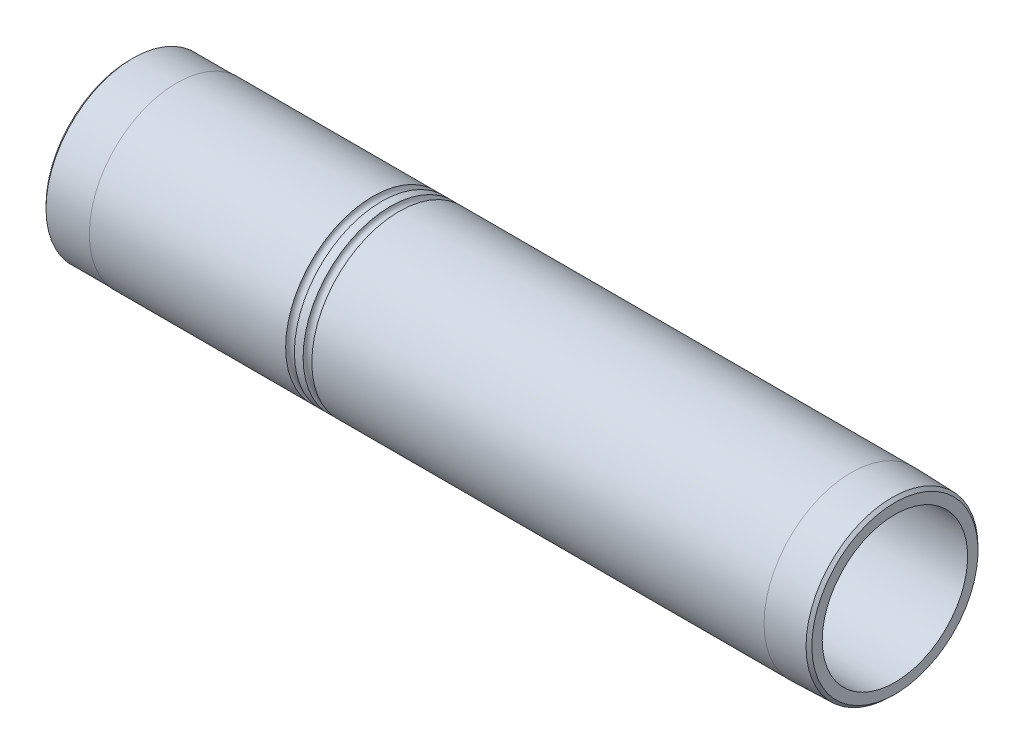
ISO-10303-21;
HEADER;
FILE_DESCRIPTION(('STEP AP214'),'2;1');
FILE_NAME('part.step','',(''),(''),'','','');
FILE_SCHEMA(('AUTOMOTIVE_DESIGN { 1 0 10303 214 1 1 1 1 }'));
ENDSEC;
DATA;
#1=APPLICATION_CONTEXT('core data for automotive mechanical design processes');
#2=APPLICATION_PROTOCOL_DEFINITION('international standard','automotive_design',2000,#1);
#3=PRODUCT_CONTEXT('',#1,'mechanical');
#4=PRODUCT('Part','Part','',(#3));
#5=PRODUCT_RELATED_PRODUCT_CATEGORY('part','',(#4));
#6=PRODUCT_DEFINITION_FORMATION('','',#4);
#7=PRODUCT_DEFINITION_CONTEXT('part definition',#1,'design');
#8=PRODUCT_DEFINITION('design','',#6,#7);
#9=PRODUCT_DEFINITION_SHAPE('','',#8);
#10=(LENGTH_UNIT() NAMED_UNIT(*) SI_UNIT(.MILLI.,.METRE.));
#11=(NAMED_UNIT(*) PLANE_ANGLE_UNIT() SI_UNIT($,.RADIAN.));
#12=(NAMED_UNIT(*) SI_UNIT($,.STERADIAN.) SOLID_ANGLE_UNIT());
#13=UNCERTAINTY_MEASURE_WITH_UNIT(LENGTH_MEASURE(1.E-05),#10,'distance_accuracy_value','');
#14=(GEOMETRIC_REPRESENTATION_CONTEXT(3) GLOBAL_UNCERTAINTY_ASSIGNED_CONTEXT((#13)) GLOBAL_UNIT_ASSIGNED_CONTEXT((#10,
#11,#12)) REPRESENTATION_CONTEXT('',''));
#15=CARTESIAN_POINT('',(0.,0.,0.));
#16=DIRECTION('',(0.,0.,1.));
#17=DIRECTION('',(1.,0.,0.));
#18=AXIS2_PLACEMENT_3D('',#15,#16,#17);
#19=CARTESIAN_POINT('',(0.,0.,0.));
#20=DIRECTION('',(-1.,0.,0.));
#21=DIRECTION('',(0.,0.,1.));
#22=AXIS2_PLACEMENT_3D('',#19,#20,#21);
#23=CYLINDRICAL_SURFACE('',#22,25.);
#24=CARTESIAN_POINT('',(165.,0.,0.));
#25=DIRECTION('',(-1.,0.,0.));
#26=DIRECTION('',(0.,0.,1.));
#27=AXIS2_PLACEMENT_3D('',#24,#25,#26);
#28=CIRCLE('',#27,25.);
#29=CARTESIAN_POINT('',(165.,0.,25.));
#30=VERTEX_POINT('',#29);
#31=EDGE_CURVE('E68',#30,#30,#28,.F.);
#32=ORIENTED_EDGE('',*,*,#31,.F.);
#33=EDGE_LOOP('',(#32));
#34=FACE_BOUND('',#33,.T.);
#35=CARTESIAN_POINT('',(211.8,0.,0.));
#36=DIRECTION('',(1.,0.,0.));
#37=DIRECTION('',(0.,0.,-1.));
#38=AXIS2_PLACEMENT_3D('',#35,#36,#37);
#39=CIRCLE('',#38,25.);
#40=CARTESIAN_POINT('',(211.8,0.,-25.));
#41=VERTEX_POINT('',#40);
#42=EDGE_CURVE('E39',#41,#41,#39,.F.);
#43=ORIENTED_EDGE('',*,*,#42,.F.);
#44=EDGE_LOOP('',(#43));
#45=FACE_BOUND('',#44,.T.);
#46=ADVANCED_FACE('F35',(#34,#45),#23,.F.);
#47=CARTESIAN_POINT('',(428.,0.,0.));
#48=DIRECTION('',(-1.,0.,0.));
#49=DIRECTION('',(0.,0.,1.));
#50=AXIS2_PLACEMENT_3D('',#47,#48,#49);
#51=CIRCLE('',#50,25.);
#52=CARTESIAN_POINT('',(428.,0.,25.));
#53=VERTEX_POINT('',#52);
#54=EDGE_CURVE('E48',#53,#53,#51,.T.);
#55=ORIENTED_EDGE('',*,*,#54,.F.);
#56=EDGE_LOOP('',(#55));
#57=FACE_BOUND('',#56,.T.);
#58=CARTESIAN_POINT('',(215.,0.,0.));
#59=DIRECTION('',(-1.,0.,0.));
#60=DIRECTION('',(0.,0.,1.));
#61=AXIS2_PLACEMENT_3D('',#58,#59,#60);
#62=CIRCLE('',#61,25.);
#63=CARTESIAN_POINT('',(215.,0.,25.));
#64=VERTEX_POINT('',#63);
#65=EDGE_CURVE('E75',#64,#64,#62,.F.);
#66=ORIENTED_EDGE('',*,*,#65,.F.);
#67=EDGE_LOOP('',(#66));
#68=FACE_BOUND('',#67,.T.);
#69=ADVANCED_FACE('F111',(#57,#68),#23,.F.);
#70=CARTESIAN_POINT('',(0.,0.,0.));
#71=DIRECTION('',(-1.,0.,0.));
#72=DIRECTION('',(0.,0.,1.));
#73=AXIS2_PLACEMENT_3D('',#70,#71,#72);
#74=CYLINDRICAL_SURFACE('',#73,30.);
#75=CARTESIAN_POINT('',(248.5,0.,0.));
#76=DIRECTION('',(1.,0.,0.));
#77=DIRECTION('',(0.,0.,-1.));
#78=AXIS2_PLACEMENT_3D('',#75,#76,#77);
#79=CIRCLE('',#78,30.);
#80=CARTESIAN_POINT('',(248.5,0.,-30.));
#81=VERTEX_POINT('',#80);
#82=EDGE_CURVE('E60',#81,#81,#79,.T.);
#83=ORIENTED_EDGE('',*,*,#82,.F.);
#84=EDGE_LOOP('',(#83));
#85=FACE_BOUND('',#84,.T.);
#86=CARTESIAN_POINT('',(181.,0.,0.));
#87=DIRECTION('',(-1.,0.,0.));
#88=DIRECTION('',(0.,0.,1.));
#89=AXIS2_PLACEMENT_3D('',#86,#87,#88);
#90=CIRCLE('',#89,30.);
#91=CARTESIAN_POINT('',(181.,0.,30.));
#92=VERTEX_POINT('',#91);
#93=EDGE_CURVE('E71',#92,#92,#90,.T.);
#94=ORIENTED_EDGE('',*,*,#93,.F.);
#95=EDGE_LOOP('',(#94));
#96=FACE_BOUND('',#95,.T.);
#97=ADVANCED_FACE('F114',(#85,#96),#74,.T.);
#98=CARTESIAN_POINT('',(254.5,0.,0.));
#99=DIRECTION('',(1.,0.,0.));
#100=DIRECTION('',(0.,0.,-1.));
#101=AXIS2_PLACEMENT_3D('',#98,#99,#100);
#102=CIRCLE('',#101,30.);
#103=CARTESIAN_POINT('',(254.5,0.,-30.));
#104=VERTEX_POINT('',#103);
#105=EDGE_CURVE('E55',#104,#104,#102,.T.);
#106=ORIENTED_EDGE('',*,*,#105,.F.);
#107=EDGE_LOOP('',(#106));
#108=FACE_BOUND('',#107,.T.);
#109=CARTESIAN_POINT('',(251.5,0.,0.));
#110=DIRECTION('',(-1.,0.,0.));
#111=DIRECTION('',(0.,0.,1.));
#112=AXIS2_PLACEMENT_3D('',#109,#110,#111);
#113=CIRCLE('',#112,30.);
#114=CARTESIAN_POINT('',(251.5,0.,30.));
#115=VERTEX_POINT('',#114);
#116=EDGE_CURVE('E63',#115,#115,#113,.T.);
#117=ORIENTED_EDGE('',*,*,#116,.F.);
#118=EDGE_LOOP('',(#117));
#119=FACE_BOUND('',#118,.T.);
#120=ADVANCED_FACE('F120',(#108,#119),#74,.T.);
#121=CARTESIAN_POINT('',(413.,0.,0.));
#122=DIRECTION('',(-1.,0.,0.));
#123=DIRECTION('',(0.,0.,1.));
#124=AXIS2_PLACEMENT_3D('',#121,#122,#123);
#125=CIRCLE('',#124,30.);
#126=CARTESIAN_POINT('',(413.,0.,30.));
#127=VERTEX_POINT('',#126);
#128=EDGE_CURVE('E59',#127,#127,#125,.T.);
#129=ORIENTED_EDGE('',*,*,#128,.T.);
#130=EDGE_LOOP('',(#129));
#131=FACE_BOUND('',#130,.T.);
#132=CARTESIAN_POINT('',(257.5,0.,0.));
#133=DIRECTION('',(-1.,0.,0.));
#134=DIRECTION('',(0.,0.,1.));
#135=AXIS2_PLACEMENT_3D('',#132,#133,#134);
#136=CIRCLE('',#135,30.);
#137=CARTESIAN_POINT('',(257.5,0.,30.));
#138=VERTEX_POINT('',#137);
#139=EDGE_CURVE('E52',#138,#138,#136,.T.);
#140=ORIENTED_EDGE('',*,*,#139,.F.);
#141=EDGE_LOOP('',(#140));
#142=FACE_BOUND('',#141,.T.);
#143=ADVANCED_FACE('F123',(#131,#142),#74,.T.);
#144=CARTESIAN_POINT('',(427.,0.,0.));
#145=DIRECTION('',(-1.,0.,0.));
#146=DIRECTION('',(0.,0.,1.));
#147=AXIS2_PLACEMENT_3D('',#144,#145,#146);
#148=CONICAL_SURFACE('',#147,29.5654131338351,0.0310319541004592);
#149=ORIENTED_EDGE('',*,*,#128,.F.);
#150=EDGE_LOOP('',(#149));
#151=FACE_BOUND('',#150,.T.);
#152=CARTESIAN_POINT('',(427.,0.,0.));
#153=DIRECTION('',(-1.,0.,0.));
#154=DIRECTION('',(0.,0.,1.));
#155=AXIS2_PLACEMENT_3D('',#152,#153,#154);
#156=CIRCLE('',#155,29.5654131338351);
#157=CARTESIAN_POINT('',(427.,0.,29.5654131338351));
#158=VERTEX_POINT('',#157);
#159=EDGE_CURVE('E10',#158,#158,#156,.T.);
#160=ORIENTED_EDGE('',*,*,#159,.T.);
#161=EDGE_LOOP('',(#160));
#162=FACE_BOUND('',#161,.T.);
#163=ADVANCED_FACE('F37',(#151,#162),#148,.T.);
#164=CARTESIAN_POINT('',(428.,0.,0.));
#165=DIRECTION('',(-1.,0.,0.));
#166=DIRECTION('',(0.,0.,1.));
#167=AXIS2_PLACEMENT_3D('',#164,#165,#166);
#168=CONICAL_SURFACE('',#167,28.5654131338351,0.785398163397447);
#169=ORIENTED_EDGE('',*,*,#159,.F.);
#170=EDGE_LOOP('',(#169));
#171=FACE_BOUND('',#170,.T.);
#172=CARTESIAN_POINT('',(428.,0.,0.));
#173=DIRECTION('',(-1.,0.,0.));
#174=DIRECTION('',(0.,0.,1.));
#175=AXIS2_PLACEMENT_3D('',#172,#173,#174);
#176=CIRCLE('',#175,28.5654131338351);
#177=CARTESIAN_POINT('',(428.,0.,28.5654131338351));
#178=VERTEX_POINT('',#177);
#179=EDGE_CURVE('E43',#178,#178,#176,.T.);
#180=ORIENTED_EDGE('',*,*,#179,.T.);
#181=EDGE_LOOP('',(#180));
#182=FACE_BOUND('',#181,.T.);
#183=ADVANCED_FACE('F129',(#171,#182),#168,.T.);
#184=CARTESIAN_POINT('',(428.,28.5654131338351,0.));
#185=DIRECTION('',(-1.,0.,0.));
#186=DIRECTION('',(0.,0.,1.));
#187=AXIS2_PLACEMENT_3D('',#184,#185,#186);
#188=PLANE('',#187);
#189=ORIENTED_EDGE('',*,*,#179,.F.);
#190=EDGE_LOOP('',(#189));
#191=FACE_BOUND('',#190,.T.);
#192=ORIENTED_EDGE('',*,*,#54,.T.);
#193=EDGE_LOOP('',(#192));
#194=FACE_BOUND('',#193,.T.);
#195=ADVANCED_FACE('F109',(#191,#194),#188,.F.);
#196=CARTESIAN_POINT('',(254.5,31.475,0.));
#197=DIRECTION('',(1.,0.,0.));
#198=DIRECTION('',(0.,0.,-1.));
#199=AXIS2_PLACEMENT_3D('',#196,#197,#198);
#200=PLANE('',#199);
#201=CARTESIAN_POINT('',(254.5,0.,0.));
#202=DIRECTION('',(-1.,0.,0.));
#203=DIRECTION('',(0.,0.,1.));
#204=AXIS2_PLACEMENT_3D('',#201,#202,#203);
#205=CIRCLE('',#204,29.975);
#206=CARTESIAN_POINT('',(254.5,0.,29.975));
#207=VERTEX_POINT('',#206);
#208=EDGE_CURVE('E56',#207,#207,#205,.T.);
#209=ORIENTED_EDGE('',*,*,#208,.T.);
#210=EDGE_LOOP('',(#209));
#211=FACE_BOUND('',#210,.T.);
#212=ORIENTED_EDGE('',*,*,#105,.T.);
#213=EDGE_LOOP('',(#212));
#214=FACE_BOUND('',#213,.T.);
#215=ADVANCED_FACE('F128',(#211,#214),#200,.T.);
#216=CARTESIAN_POINT('',(257.5,31.475,0.));
#217=DIRECTION('',(-1.,0.,0.));
#218=DIRECTION('',(0.,0.,1.));
#219=AXIS2_PLACEMENT_3D('',#216,#217,#218);
#220=PLANE('',#219);
#221=CARTESIAN_POINT('',(257.5,0.,0.));
#222=DIRECTION('',(-1.,0.,0.));
#223=DIRECTION('',(0.,0.,1.));
#224=AXIS2_PLACEMENT_3D('',#221,#222,#223);
#225=CIRCLE('',#224,29.975);
#226=CARTESIAN_POINT('',(257.5,0.,29.975));
#227=VERTEX_POINT('',#226);
#228=EDGE_CURVE('E67',#227,#227,#225,.T.);
#229=ORIENTED_EDGE('',*,*,#228,.F.);
#230=EDGE_LOOP('',(#229));
#231=FACE_BOUND('',#230,.T.);
#232=ORIENTED_EDGE('',*,*,#139,.T.);
#233=EDGE_LOOP('',(#232));
#234=FACE_BOUND('',#233,.T.);
#235=ADVANCED_FACE('F147',(#231,#234),#220,.T.);
#236=CARTESIAN_POINT('',(256.,0.,0.));
#237=DIRECTION('',(-1.,0.,0.));
#238=DIRECTION('',(0.,0.,1.));
#239=AXIS2_PLACEMENT_3D('',#236,#237,#238);
#240=TOROIDAL_SURFACE('',#239,29.975,1.49999999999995);
#241=ORIENTED_EDGE('',*,*,#228,.T.);
#242=EDGE_LOOP('',(#241));
#243=FACE_BOUND('',#242,.T.);
#244=ORIENTED_EDGE('',*,*,#208,.F.);
#245=EDGE_LOOP('',(#244));
#246=FACE_BOUND('',#245,.T.);
#247=ADVANCED_FACE('F149',(#243,#246),#240,.F.);
#248=CARTESIAN_POINT('',(251.5,31.475,0.));
#249=DIRECTION('',(-1.,0.,0.));
#250=DIRECTION('',(0.,0.,1.));
#251=AXIS2_PLACEMENT_3D('',#248,#249,#250);
#252=PLANE('',#251);
#253=CARTESIAN_POINT('',(251.5,0.,0.));
#254=DIRECTION('',(-1.,0.,0.));
#255=DIRECTION('',(0.,0.,1.));
#256=AXIS2_PLACEMENT_3D('',#253,#254,#255);
#257=CIRCLE('',#256,29.975);
#258=CARTESIAN_POINT('',(251.5,0.,29.975));
#259=VERTEX_POINT('',#258);
#260=EDGE_CURVE('E64',#259,#259,#257,.T.);
#261=ORIENTED_EDGE('',*,*,#260,.F.);
#262=EDGE_LOOP('',(#261));
#263=FACE_BOUND('',#262,.T.);
#264=ORIENTED_EDGE('',*,*,#116,.T.);
#265=EDGE_LOOP('',(#264));
#266=FACE_BOUND('',#265,.T.);
#267=ADVANCED_FACE('F156',(#263,#266),#252,.T.);
#268=CARTESIAN_POINT('',(248.5,29.975,0.));
#269=DIRECTION('',(1.,0.,0.));
#270=DIRECTION('',(0.,0.,-1.));
#271=AXIS2_PLACEMENT_3D('',#268,#269,#270);
#272=PLANE('',#271);
#273=CARTESIAN_POINT('',(248.5,0.,0.));
#274=DIRECTION('',(-1.,0.,0.));
#275=DIRECTION('',(0.,0.,1.));
#276=AXIS2_PLACEMENT_3D('',#273,#274,#275);
#277=CIRCLE('',#276,29.975);
#278=CARTESIAN_POINT('',(248.5,0.,29.975));
#279=VERTEX_POINT('',#278);
#280=EDGE_CURVE('E74',#279,#279,#277,.T.);
#281=ORIENTED_EDGE('',*,*,#280,.T.);
#282=EDGE_LOOP('',(#281));
#283=FACE_BOUND('',#282,.T.);
#284=ORIENTED_EDGE('',*,*,#82,.T.);
#285=EDGE_LOOP('',(#284));
#286=FACE_BOUND('',#285,.T.);
#287=ADVANCED_FACE('F166',(#283,#286),#272,.T.);
#288=CARTESIAN_POINT('',(250.,0.,0.));
#289=DIRECTION('',(-1.,0.,0.));
#290=DIRECTION('',(0.,0.,1.));
#291=AXIS2_PLACEMENT_3D('',#288,#289,#290);
#292=TOROIDAL_SURFACE('',#291,29.975,1.49999999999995);
#293=ORIENTED_EDGE('',*,*,#260,.T.);
#294=EDGE_LOOP('',(#293));
#295=FACE_BOUND('',#294,.T.);
#296=ORIENTED_EDGE('',*,*,#280,.F.);
#297=EDGE_LOOP('',(#296));
#298=FACE_BOUND('',#297,.T.);
#299=ADVANCED_FACE('F162',(#295,#298),#292,.F.);
#300=CARTESIAN_POINT('',(181.,29.9,0.));
#301=DIRECTION('',(-1.,0.,0.));
#302=DIRECTION('',(0.,0.,1.));
#303=AXIS2_PLACEMENT_3D('',#300,#301,#302);
#304=PLANE('',#303);
#305=CARTESIAN_POINT('',(181.,0.,0.));
#306=DIRECTION('',(-1.,0.,0.));
#307=DIRECTION('',(0.,0.,1.));
#308=AXIS2_PLACEMENT_3D('',#305,#306,#307);
#309=CIRCLE('',#308,29.9);
#310=CARTESIAN_POINT('',(181.,0.,29.9));
#311=VERTEX_POINT('',#310);
#312=EDGE_CURVE('E81',#311,#311,#309,.T.);
#313=ORIENTED_EDGE('',*,*,#312,.F.);
#314=EDGE_LOOP('',(#313));
#315=FACE_BOUND('',#314,.T.);
#316=ORIENTED_EDGE('',*,*,#93,.T.);
#317=EDGE_LOOP('',(#316));
#318=FACE_BOUND('',#317,.T.);
#319=ADVANCED_FACE('F165',(#315,#318),#304,.T.);
#320=CARTESIAN_POINT('',(165.,0.,0.));
#321=DIRECTION('',(-1.,0.,0.));
#322=DIRECTION('',(0.,0.,1.));
#323=AXIS2_PLACEMENT_3D('',#320,#321,#322);
#324=PLANE('',#323);
#325=CARTESIAN_POINT('',(165.,0.,0.));
#326=DIRECTION('',(-1.,0.,0.));
#327=DIRECTION('',(0.,0.,1.));
#328=AXIS2_PLACEMENT_3D('',#325,#326,#327);
#329=CIRCLE('',#328,28.9);
#330=CARTESIAN_POINT('',(165.,0.,28.9));
#331=VERTEX_POINT('',#330);
#332=EDGE_CURVE('E72',#331,#331,#329,.T.);
#333=ORIENTED_EDGE('',*,*,#332,.T.);
#334=EDGE_LOOP('',(#333));
#335=FACE_BOUND('',#334,.T.);
#336=ORIENTED_EDGE('',*,*,#31,.T.);
#337=EDGE_LOOP('',(#336));
#338=FACE_BOUND('',#337,.T.);
#339=ADVANCED_FACE('F174',(#335,#338),#324,.T.);
#340=CARTESIAN_POINT('',(165.,0.,0.));
#341=DIRECTION('',(1.,0.,0.));
#342=DIRECTION('',(0.,0.,-1.));
#343=AXIS2_PLACEMENT_3D('',#340,#341,#342);
#344=CONICAL_SURFACE('',#343,28.9,0.785398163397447);
#345=CARTESIAN_POINT('',(166.,0.,0.));
#346=DIRECTION('',(-1.,0.,0.));
#347=DIRECTION('',(0.,0.,1.));
#348=AXIS2_PLACEMENT_3D('',#345,#346,#347);
#349=CIRCLE('',#348,29.9);
#350=CARTESIAN_POINT('',(166.,0.,29.9));
#351=VERTEX_POINT('',#350);
#352=EDGE_CURVE('E92',#351,#351,#349,.T.);
#353=ORIENTED_EDGE('',*,*,#352,.T.);
#354=EDGE_LOOP('',(#353));
#355=FACE_BOUND('',#354,.T.);
#356=ORIENTED_EDGE('',*,*,#332,.F.);
#357=EDGE_LOOP('',(#356));
#358=FACE_BOUND('',#357,.T.);
#359=ADVANCED_FACE('F177',(#355,#358),#344,.T.);
#360=CARTESIAN_POINT('',(0.,0.,0.));
#361=DIRECTION('',(-1.,0.,0.));
#362=DIRECTION('',(0.,0.,1.));
#363=AXIS2_PLACEMENT_3D('',#360,#361,#362);
#364=CYLINDRICAL_SURFACE('',#363,29.9);
#365=ORIENTED_EDGE('',*,*,#312,.T.);
#366=EDGE_LOOP('',(#365));
#367=FACE_BOUND('',#366,.T.);
#368=ORIENTED_EDGE('',*,*,#352,.F.);
#369=EDGE_LOOP('',(#368));
#370=FACE_BOUND('',#369,.T.);
#371=ADVANCED_FACE('F181',(#367,#370),#364,.T.);
#372=CARTESIAN_POINT('',(211.8,26.75,0.));
#373=DIRECTION('',(1.,0.,0.));
#374=DIRECTION('',(0.,0.,-1.));
#375=AXIS2_PLACEMENT_3D('',#372,#373,#374);
#376=PLANE('',#375);
#377=CARTESIAN_POINT('',(211.8,0.,0.));
#378=DIRECTION('',(-1.,0.,0.));
#379=DIRECTION('',(0.,0.,1.));
#380=AXIS2_PLACEMENT_3D('',#377,#378,#379);
#381=CIRCLE('',#380,26.75);
#382=CARTESIAN_POINT('',(211.8,0.,26.75));
#383=VERTEX_POINT('',#382);
#384=EDGE_CURVE('E83',#383,#383,#381,.T.);
#385=ORIENTED_EDGE('',*,*,#384,.F.);
#386=EDGE_LOOP('',(#385));
#387=FACE_BOUND('',#386,.T.);
#388=ORIENTED_EDGE('',*,*,#42,.T.);
#389=EDGE_LOOP('',(#388));
#390=FACE_BOUND('',#389,.T.);
#391=ADVANCED_FACE('F185',(#387,#390),#376,.T.);
#392=CARTESIAN_POINT('',(215.,26.75,0.));
#393=DIRECTION('',(-1.,0.,0.));
#394=DIRECTION('',(0.,0.,1.));
#395=AXIS2_PLACEMENT_3D('',#392,#393,#394);
#396=PLANE('',#395);
#397=CARTESIAN_POINT('',(215.,0.,0.));
#398=DIRECTION('',(-1.,0.,0.));
#399=DIRECTION('',(0.,0.,1.));
#400=AXIS2_PLACEMENT_3D('',#397,#398,#399);
#401=CIRCLE('',#400,26.75);
#402=CARTESIAN_POINT('',(215.,0.,26.75));
#403=VERTEX_POINT('',#402);
#404=EDGE_CURVE('E77',#403,#403,#401,.T.);
#405=ORIENTED_EDGE('',*,*,#404,.T.);
#406=EDGE_LOOP('',(#405));
#407=FACE_BOUND('',#406,.T.);
#408=ORIENTED_EDGE('',*,*,#65,.T.);
#409=EDGE_LOOP('',(#408));
#410=FACE_BOUND('',#409,.T.);
#411=ADVANCED_FACE('F192',(#407,#410),#396,.T.);
#412=CARTESIAN_POINT('',(211.8,0.,0.));
#413=DIRECTION('',(-1.,0.,0.));
#414=DIRECTION('',(0.,0.,1.));
#415=AXIS2_PLACEMENT_3D('',#412,#413,#414);
#416=CYLINDRICAL_SURFACE('',#415,26.75);
#417=ORIENTED_EDGE('',*,*,#384,.T.);
#418=EDGE_LOOP('',(#417));
#419=FACE_BOUND('',#418,.T.);
#420=ORIENTED_EDGE('',*,*,#404,.F.);
#421=EDGE_LOOP('',(#420));
#422=FACE_BOUND('',#421,.T.);
#423=ADVANCED_FACE('F196',(#419,#422),#416,.F.);
#424=CLOSED_SHELL('',(#46,#69,#97,#120,#143,#163,#183,#195,#215,#235,#247,#267,#287,#299,#319,
#339,#359,#371,#391,#411,#423));
#425=MANIFOLD_SOLID_BREP('B2',#424);
#426=ADVANCED_BREP_SHAPE_REPRESENTATION('',(#18,#425),#14);
#427=SHAPE_DEFINITION_REPRESENTATION(#9,#426);
ENDSEC;
END-ISO-10303-21;
